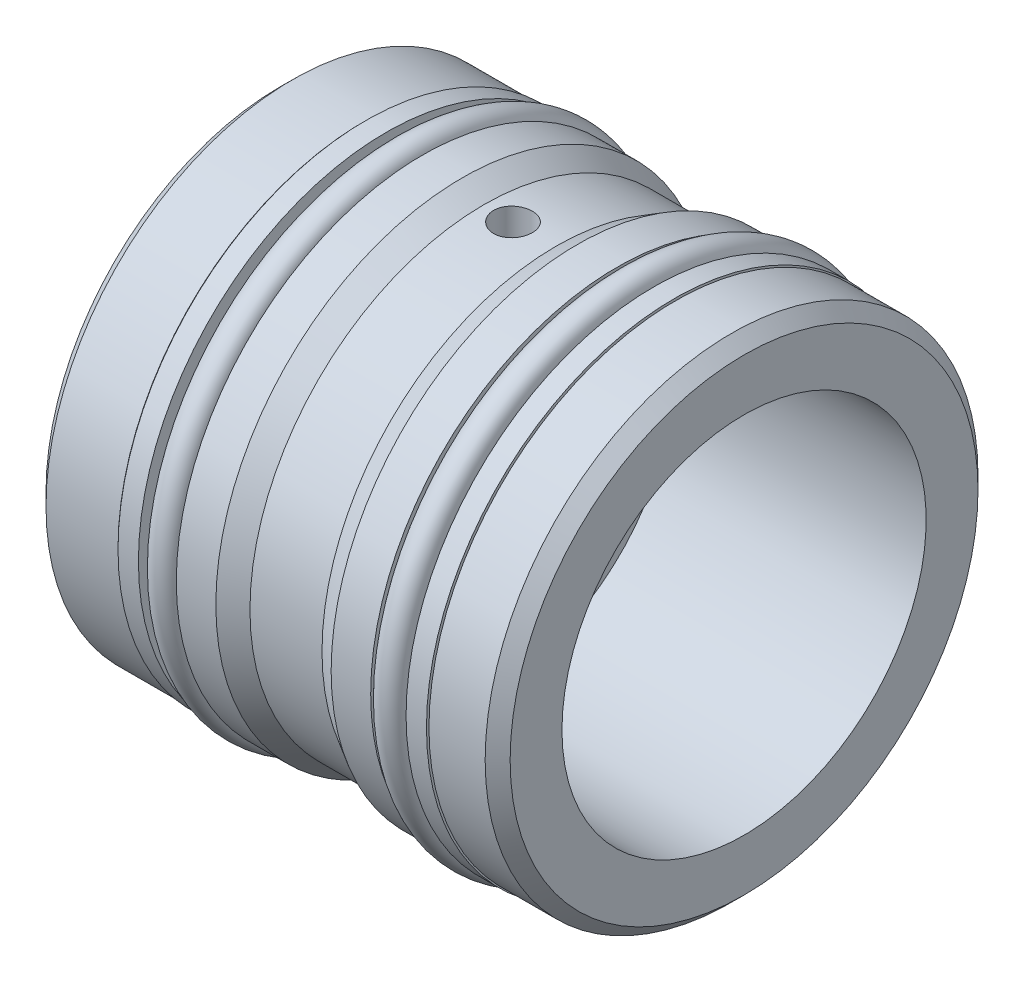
from build123d import *

# Parameters (mm, degrees)
FILLET1_R               = 0.381
CHAMFER1_SIZE           = 0.762
SKETCH6_R               = 0.889
SKETCH6_W               = 1.2446
SKETCH6_H               = 1.3462
CUT_EXTRUDE1_DEPTH      = 27.059066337
CUT_EXTRUDE1_DEPTH_BACK = 27.059066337
SKETCH7_R               = 1.1811


with BuildPart() as part:
    # Sketch1 → Revolve1 (revolve)
    with BuildSketch(Plane.XY, mode=Mode.PRIVATE) as revolve1_sk:
        Polygon((-14.1605, 6.35), (-14.1605, 15.0368), (-9.0043, 15.0368), (-9.0043, 13.7668), (-5.4483, 13.7668), (-5.4483, 15.0368), (-3.0353, 15.0368), (-3.0353, 14.2748), (4.0005, 14.2748), (4.0005, 15.0368), (6.4135, 15.0368), (6.4135, 13.7668), (9.9695, 13.7668), (9.9695, 15.0368), (14.1605, 15.0368), (14.1605, 11.1125), (-1.2319, 11.1125), (-1.2319, 6.35), align=None)
    revolve(revolve1_sk.sketch.rotate(Axis((0, 0, 0), (1, 0, 0)), 90), axis=Axis((0, 0, 0), (1, 0, 0)))

    # Fillet1
    fillet1_edges = [part.edges().sort_by_distance(p)[0] for p in [
        (-3.0353, 0, -14.2748),
        (4.0005, 0, -14.2748),
    ]]
    fillet(fillet1_edges, radius=FILLET1_R)

    # Chamfer1
    chamfer1_edges = [part.edges().sort_by_distance(p)[0] for p in [
        (-14.1605, 0, -15.0368),
        (14.1605, 0, -15.0368),
    ]]
    chamfer(chamfer1_edges, length=CHAMFER1_SIZE)

    # Sketch6 → Revolve3 (revolve)
    with BuildSketch(Plane.XY, mode=Mode.PRIVATE) as revolve3_sk:
        with Locations((-6.4135, 14.5796)):
            Circle(SKETCH6_R)
        with Locations((7.3787, 14.5796)):
            Circle(SKETCH6_R)
        with Locations((-8.3058, 14.4399)):
            Rectangle(SKETCH6_W, SKETCH6_H)
        with Locations((9.271, 14.4399)):
            Rectangle(SKETCH6_W, SKETCH6_H)
    revolve(revolve3_sk.sketch.rotate(Axis((0, 0, 0), (1, 0, 0)), 90), axis=Axis((0, 0, 0), (1, 0, 0)))

    # Sketch7 → Cut-Extrude1 (cut, two sides: drawn at the far end of the back side and taken through both)
    with BuildSketch(Plane(origin=(0, 0, 0), x_dir=(0, 0, -1), z_dir=(0, 1, 0)).offset(-CUT_EXTRUDE1_DEPTH_BACK)):
        with Locations(Location((0, -0.0635, 0), (0, 0, 180))):
            Circle(SKETCH7_R)
    extrude(amount=CUT_EXTRUDE1_DEPTH + CUT_EXTRUDE1_DEPTH_BACK, mode=Mode.SUBTRACT)

    # Sketch8 → Revolve4 (revolve)
    with BuildSketch(Plane.XY, mode=Mode.PRIVATE) as revolve4_sk:
        Polygon((4.0005, 15.0368), (2.680677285, 14.2748), (4.0005, 14.2748), align=None)
        Polygon((-3.0353, 14.2748), (-3.0353, 15.0368), (-1.715477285, 14.2748), align=None)
    revolve(revolve4_sk.sketch.rotate(Axis((0, 0, 0), (1, 0, 0)), 90), axis=Axis((0, 0, 0), (1, 0, 0)))


solid = part.part
